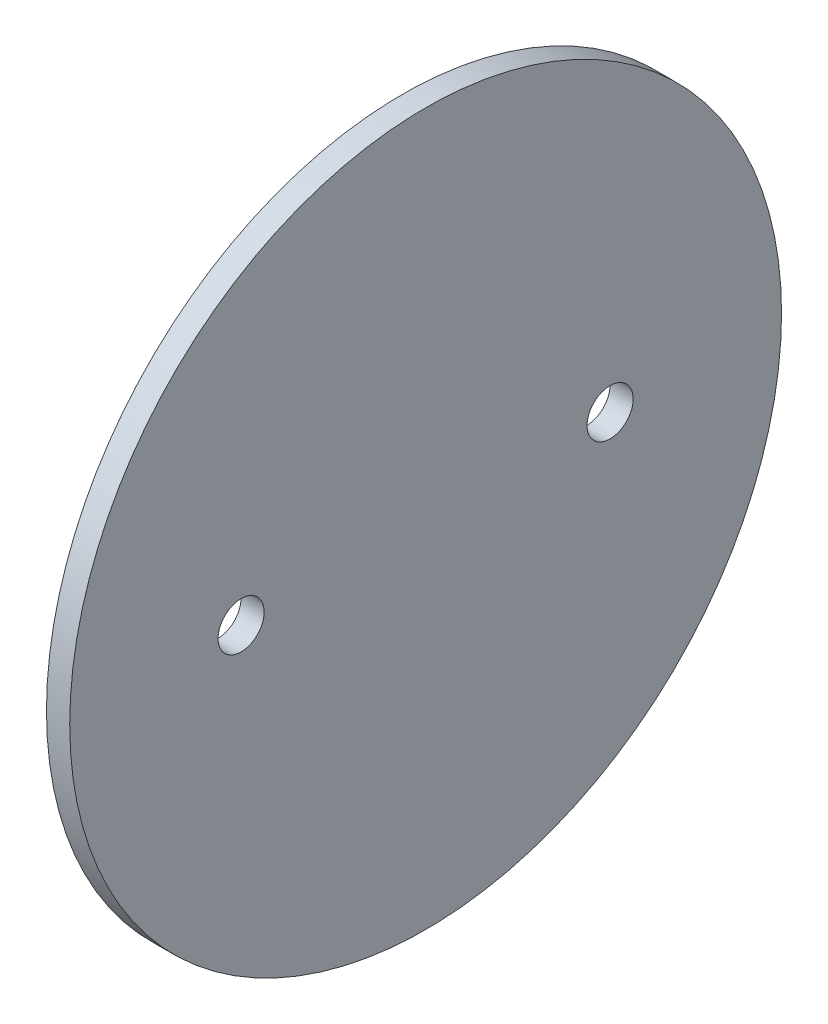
from build123d import *

# Parameters (mm, degrees)
SKETCH1_R      = 24.5
SKETCH1_R_2    = 1.5875
EXTRUDE1_DEPTH = 0.8001


with BuildPart() as part:
    # Sketch1 → Extrude1 (new, symmetric)
    with BuildSketch(Plane(origin=(0, 0, 0), x_dir=(0, 0, -1), z_dir=(1, 0, 0))):
        Circle(SKETCH1_R)
        with Locations((12.7, 0)):
            Circle(SKETCH1_R_2, mode=Mode.SUBTRACT)
        with Locations((-12.7, 0)):
            Circle(SKETCH1_R_2, mode=Mode.SUBTRACT)
    extrude(amount=EXTRUDE1_DEPTH, both=True)


solid = part.part
